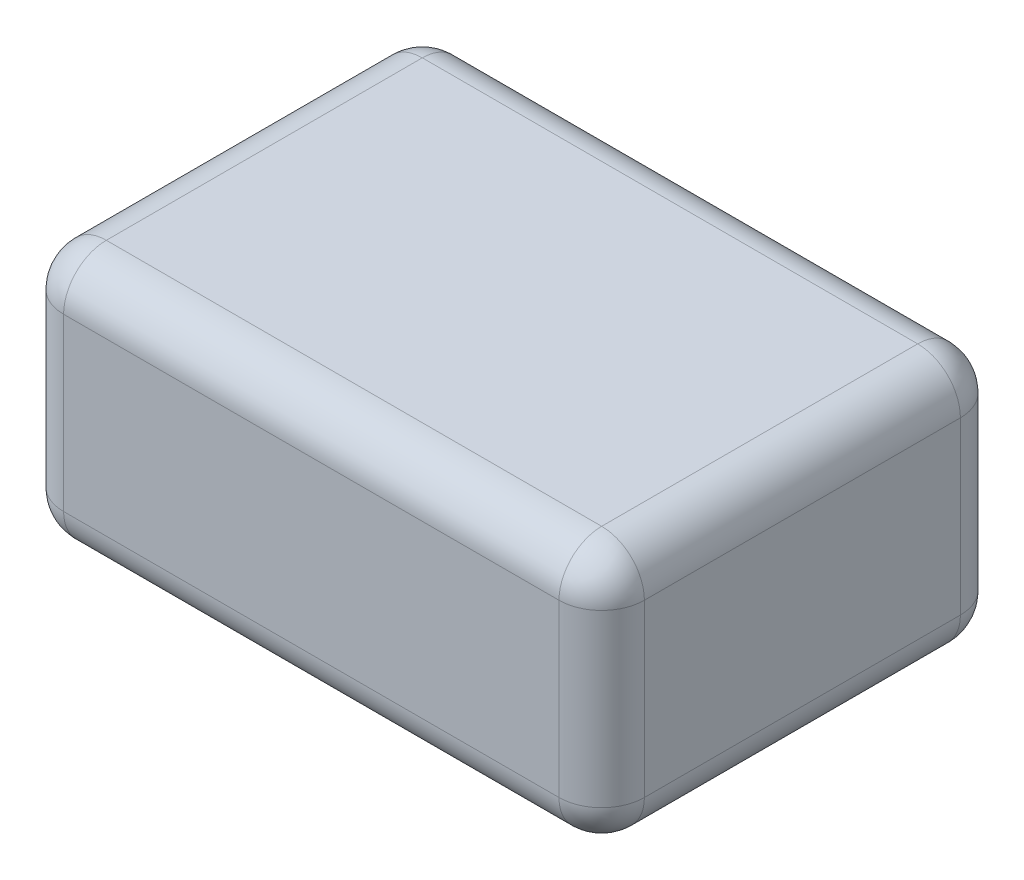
ISO-10303-21;
HEADER;
FILE_DESCRIPTION(('STEP AP214'),'2;1');
FILE_NAME('part.step','',(''),(''),'','','');
FILE_SCHEMA(('AUTOMOTIVE_DESIGN { 1 0 10303 214 1 1 1 1 }'));
ENDSEC;
DATA;
#1=APPLICATION_CONTEXT('core data for automotive mechanical design processes');
#2=APPLICATION_PROTOCOL_DEFINITION('international standard','automotive_design',2000,#1);
#3=PRODUCT_CONTEXT('',#1,'mechanical');
#4=PRODUCT('Part','Part','',(#3));
#5=PRODUCT_RELATED_PRODUCT_CATEGORY('part','',(#4));
#6=PRODUCT_DEFINITION_FORMATION('','',#4);
#7=PRODUCT_DEFINITION_CONTEXT('part definition',#1,'design');
#8=PRODUCT_DEFINITION('design','',#6,#7);
#9=PRODUCT_DEFINITION_SHAPE('','',#8);
#10=(LENGTH_UNIT() NAMED_UNIT(*) SI_UNIT(.MILLI.,.METRE.));
#11=(NAMED_UNIT(*) PLANE_ANGLE_UNIT() SI_UNIT($,.RADIAN.));
#12=(NAMED_UNIT(*) SI_UNIT($,.STERADIAN.) SOLID_ANGLE_UNIT());
#13=UNCERTAINTY_MEASURE_WITH_UNIT(LENGTH_MEASURE(1.E-05),#10,'distance_accuracy_value','');
#14=(GEOMETRIC_REPRESENTATION_CONTEXT(3) GLOBAL_UNCERTAINTY_ASSIGNED_CONTEXT((#13)) GLOBAL_UNIT_ASSIGNED_CONTEXT((#10,
#11,#12)) REPRESENTATION_CONTEXT('',''));
#15=CARTESIAN_POINT('',(0.,0.,0.));
#16=DIRECTION('',(0.,0.,1.));
#17=DIRECTION('',(1.,0.,0.));
#18=AXIS2_PLACEMENT_3D('',#15,#16,#17);
#19=CARTESIAN_POINT('',(0.,0.,47.));
#20=DIRECTION('',(1.,0.,0.));
#21=DIRECTION('',(0.,0.,-1.));
#22=AXIS2_PLACEMENT_3D('',#19,#20,#21);
#23=PLANE('',#22);
#24=DIRECTION('',(0.,0.,-1.));
#25=VECTOR('',#24,1.);
#26=CARTESIAN_POINT('',(0.,5.,47.));
#27=LINE('',#26,#25);
#28=CARTESIAN_POINT('',(0.,5.,5.));
#29=VERTEX_POINT('',#28);
#30=CARTESIAN_POINT('',(0.,5.,42.));
#31=VERTEX_POINT('',#30);
#32=EDGE_CURVE('E129',#29,#31,#27,.F.);
#33=ORIENTED_EDGE('',*,*,#32,.T.);
#34=DIRECTION('',(0.,-1.,0.));
#35=VECTOR('',#34,1.);
#36=CARTESIAN_POINT('',(0.,0.,42.));
#37=LINE('',#36,#35);
#38=CARTESIAN_POINT('',(0.,25.,42.));
#39=VERTEX_POINT('',#38);
#40=EDGE_CURVE('E166',#31,#39,#37,.F.);
#41=ORIENTED_EDGE('',*,*,#40,.T.);
#42=DIRECTION('',(0.,0.,-1.));
#43=VECTOR('',#42,1.);
#44=CARTESIAN_POINT('',(0.,25.,47.));
#45=LINE('',#44,#43);
#46=CARTESIAN_POINT('',(0.,25.,5.));
#47=VERTEX_POINT('',#46);
#48=EDGE_CURVE('E163',#39,#47,#45,.T.);
#49=ORIENTED_EDGE('',*,*,#48,.T.);
#50=DIRECTION('',(0.,-1.,0.));
#51=VECTOR('',#50,1.);
#52=CARTESIAN_POINT('',(0.,0.,5.));
#53=LINE('',#52,#51);
#54=EDGE_CURVE('E158',#47,#29,#53,.T.);
#55=ORIENTED_EDGE('',*,*,#54,.T.);
#56=EDGE_LOOP('',(#33,#41,#49,#55));
#57=FACE_BOUND('',#56,.T.);
#58=ADVANCED_FACE('F33',(#57),#23,.F.);
#59=CARTESIAN_POINT('',(0.,0.,47.));
#60=DIRECTION('',(0.,1.,0.));
#61=DIRECTION('',(0.,0.,1.));
#62=AXIS2_PLACEMENT_3D('',#59,#60,#61);
#63=PLANE('',#62);
#64=DIRECTION('',(0.,0.,-1.));
#65=VECTOR('',#64,1.);
#66=CARTESIAN_POINT('',(63.,0.,47.));
#67=LINE('',#66,#65);
#68=CARTESIAN_POINT('',(63.,0.,5.));
#69=VERTEX_POINT('',#68);
#70=CARTESIAN_POINT('',(63.,0.,42.));
#71=VERTEX_POINT('',#70);
#72=EDGE_CURVE('E151',#69,#71,#67,.F.);
#73=ORIENTED_EDGE('',*,*,#72,.T.);
#74=DIRECTION('',(1.,0.,0.));
#75=VECTOR('',#74,1.);
#76=CARTESIAN_POINT('',(0.,0.,42.));
#77=LINE('',#76,#75);
#78=CARTESIAN_POINT('',(5.,0.,42.));
#79=VERTEX_POINT('',#78);
#80=EDGE_CURVE('E155',#71,#79,#77,.F.);
#81=ORIENTED_EDGE('',*,*,#80,.T.);
#82=DIRECTION('',(0.,0.,-1.));
#83=VECTOR('',#82,1.);
#84=CARTESIAN_POINT('',(5.,0.,47.));
#85=LINE('',#84,#83);
#86=CARTESIAN_POINT('',(5.,0.,5.));
#87=VERTEX_POINT('',#86);
#88=EDGE_CURVE('E127',#79,#87,#85,.T.);
#89=ORIENTED_EDGE('',*,*,#88,.T.);
#90=DIRECTION('',(1.,0.,0.));
#91=VECTOR('',#90,1.);
#92=CARTESIAN_POINT('',(68.,0.,5.));
#93=LINE('',#92,#91);
#94=EDGE_CURVE('E145',#87,#69,#93,.T.);
#95=ORIENTED_EDGE('',*,*,#94,.T.);
#96=EDGE_LOOP('',(#73,#81,#89,#95));
#97=FACE_BOUND('',#96,.T.);
#98=ADVANCED_FACE('F153',(#97),#63,.F.);
#99=CARTESIAN_POINT('',(68.,0.,47.));
#100=DIRECTION('',(-1.,0.,0.));
#101=DIRECTION('',(0.,0.,1.));
#102=AXIS2_PLACEMENT_3D('',#99,#100,#101);
#103=PLANE('',#102);
#104=DIRECTION('',(0.,0.,-1.));
#105=VECTOR('',#104,1.);
#106=CARTESIAN_POINT('',(68.,25.,47.));
#107=LINE('',#106,#105);
#108=CARTESIAN_POINT('',(68.,25.,5.));
#109=VERTEX_POINT('',#108);
#110=CARTESIAN_POINT('',(68.,25.,42.));
#111=VERTEX_POINT('',#110);
#112=EDGE_CURVE('E170',#109,#111,#107,.F.);
#113=ORIENTED_EDGE('',*,*,#112,.T.);
#114=DIRECTION('',(0.,1.,0.));
#115=VECTOR('',#114,1.);
#116=CARTESIAN_POINT('',(68.,0.,42.));
#117=LINE('',#116,#115);
#118=CARTESIAN_POINT('',(68.,5.,42.));
#119=VERTEX_POINT('',#118);
#120=EDGE_CURVE('E175',#111,#119,#117,.F.);
#121=ORIENTED_EDGE('',*,*,#120,.T.);
#122=DIRECTION('',(0.,0.,-1.));
#123=VECTOR('',#122,1.);
#124=CARTESIAN_POINT('',(68.,5.,47.));
#125=LINE('',#124,#123);
#126=CARTESIAN_POINT('',(68.,5.,5.));
#127=VERTEX_POINT('',#126);
#128=EDGE_CURVE('E172',#119,#127,#125,.T.);
#129=ORIENTED_EDGE('',*,*,#128,.T.);
#130=DIRECTION('',(0.,1.,0.));
#131=VECTOR('',#130,1.);
#132=CARTESIAN_POINT('',(68.,30.,5.));
#133=LINE('',#132,#131);
#134=EDGE_CURVE('E168',#127,#109,#133,.T.);
#135=ORIENTED_EDGE('',*,*,#134,.T.);
#136=EDGE_LOOP('',(#113,#121,#129,#135));
#137=FACE_BOUND('',#136,.T.);
#138=ADVANCED_FACE('F280',(#137),#103,.F.);
#139=CARTESIAN_POINT('',(0.,30.,47.));
#140=DIRECTION('',(0.,-1.,0.));
#141=DIRECTION('',(0.,0.,-1.));
#142=AXIS2_PLACEMENT_3D('',#139,#140,#141);
#143=PLANE('',#142);
#144=DIRECTION('',(0.,0.,-1.));
#145=VECTOR('',#144,1.);
#146=CARTESIAN_POINT('',(5.,30.,47.));
#147=LINE('',#146,#145);
#148=CARTESIAN_POINT('',(5.,30.,5.));
#149=VERTEX_POINT('',#148);
#150=CARTESIAN_POINT('',(5.,30.,42.));
#151=VERTEX_POINT('',#150);
#152=EDGE_CURVE('E179',#149,#151,#147,.F.);
#153=ORIENTED_EDGE('',*,*,#152,.T.);
#154=DIRECTION('',(-1.,0.,0.));
#155=VECTOR('',#154,1.);
#156=CARTESIAN_POINT('',(0.,30.,42.));
#157=LINE('',#156,#155);
#158=CARTESIAN_POINT('',(63.,30.,42.));
#159=VERTEX_POINT('',#158);
#160=EDGE_CURVE('E184',#151,#159,#157,.F.);
#161=ORIENTED_EDGE('',*,*,#160,.T.);
#162=DIRECTION('',(0.,0.,-1.));
#163=VECTOR('',#162,1.);
#164=CARTESIAN_POINT('',(63.,30.,47.));
#165=LINE('',#164,#163);
#166=CARTESIAN_POINT('',(63.,30.,5.));
#167=VERTEX_POINT('',#166);
#168=EDGE_CURVE('E181',#159,#167,#165,.T.);
#169=ORIENTED_EDGE('',*,*,#168,.T.);
#170=DIRECTION('',(-1.,0.,0.));
#171=VECTOR('',#170,1.);
#172=CARTESIAN_POINT('',(0.,30.,5.));
#173=LINE('',#172,#171);
#174=EDGE_CURVE('E177',#167,#149,#173,.T.);
#175=ORIENTED_EDGE('',*,*,#174,.T.);
#176=EDGE_LOOP('',(#153,#161,#169,#175));
#177=FACE_BOUND('',#176,.T.);
#178=ADVANCED_FACE('F291',(#177),#143,.F.);
#179=CARTESIAN_POINT('',(0.,30.,47.));
#180=DIRECTION('',(0.,0.,-1.));
#181=DIRECTION('',(-1.,0.,0.));
#182=AXIS2_PLACEMENT_3D('',#179,#180,#181);
#183=PLANE('',#182);
#184=DIRECTION('',(0.,1.,0.));
#185=VECTOR('',#184,1.);
#186=CARTESIAN_POINT('',(63.,30.,47.));
#187=LINE('',#186,#185);
#188=CARTESIAN_POINT('',(63.,5.,47.));
#189=VERTEX_POINT('',#188);
#190=CARTESIAN_POINT('',(63.,25.,47.));
#191=VERTEX_POINT('',#190);
#192=EDGE_CURVE('E190',#189,#191,#187,.T.);
#193=ORIENTED_EDGE('',*,*,#192,.T.);
#194=DIRECTION('',(-1.,0.,0.));
#195=VECTOR('',#194,1.);
#196=CARTESIAN_POINT('',(0.,25.,47.));
#197=LINE('',#196,#195);
#198=CARTESIAN_POINT('',(5.,25.,47.));
#199=VERTEX_POINT('',#198);
#200=EDGE_CURVE('E192',#191,#199,#197,.T.);
#201=ORIENTED_EDGE('',*,*,#200,.T.);
#202=DIRECTION('',(0.,-1.,0.));
#203=VECTOR('',#202,1.);
#204=CARTESIAN_POINT('',(5.,30.,47.));
#205=LINE('',#204,#203);
#206=CARTESIAN_POINT('',(5.,5.,47.));
#207=VERTEX_POINT('',#206);
#208=EDGE_CURVE('E186',#199,#207,#205,.T.);
#209=ORIENTED_EDGE('',*,*,#208,.T.);
#210=DIRECTION('',(1.,0.,0.));
#211=VECTOR('',#210,1.);
#212=CARTESIAN_POINT('',(0.,5.,47.));
#213=LINE('',#212,#211);
#214=EDGE_CURVE('E188',#207,#189,#213,.T.);
#215=ORIENTED_EDGE('',*,*,#214,.T.);
#216=EDGE_LOOP('',(#193,#201,#209,#215));
#217=FACE_BOUND('',#216,.T.);
#218=ADVANCED_FACE('F272',(#217),#183,.F.);
#219=CARTESIAN_POINT('',(0.,30.,0.));
#220=DIRECTION('',(0.,0.,-1.));
#221=DIRECTION('',(-1.,0.,0.));
#222=AXIS2_PLACEMENT_3D('',#219,#220,#221);
#223=PLANE('',#222);
#224=DIRECTION('',(0.,1.,0.));
#225=VECTOR('',#224,1.);
#226=CARTESIAN_POINT('',(63.,0.,0.));
#227=LINE('',#226,#225);
#228=CARTESIAN_POINT('',(63.,25.,0.));
#229=VERTEX_POINT('',#228);
#230=CARTESIAN_POINT('',(63.,5.,0.));
#231=VERTEX_POINT('',#230);
#232=EDGE_CURVE('E42',#229,#231,#227,.F.);
#233=ORIENTED_EDGE('',*,*,#232,.T.);
#234=DIRECTION('',(1.,0.,0.));
#235=VECTOR('',#234,1.);
#236=CARTESIAN_POINT('',(0.,5.,0.));
#237=LINE('',#236,#235);
#238=CARTESIAN_POINT('',(5.,5.,0.));
#239=VERTEX_POINT('',#238);
#240=EDGE_CURVE('E11',#231,#239,#237,.F.);
#241=ORIENTED_EDGE('',*,*,#240,.T.);
#242=DIRECTION('',(0.,-1.,0.));
#243=VECTOR('',#242,1.);
#244=CARTESIAN_POINT('',(5.,30.,0.));
#245=LINE('',#244,#243);
#246=CARTESIAN_POINT('',(5.,25.,0.));
#247=VERTEX_POINT('',#246);
#248=EDGE_CURVE('E195',#239,#247,#245,.F.);
#249=ORIENTED_EDGE('',*,*,#248,.T.);
#250=DIRECTION('',(-1.,0.,0.));
#251=VECTOR('',#250,1.);
#252=CARTESIAN_POINT('',(68.,25.,0.));
#253=LINE('',#252,#251);
#254=EDGE_CURVE('E53',#247,#229,#253,.F.);
#255=ORIENTED_EDGE('',*,*,#254,.T.);
#256=EDGE_LOOP('',(#233,#241,#249,#255));
#257=FACE_BOUND('',#256,.T.);
#258=ADVANCED_FACE('F478',(#257),#223,.T.);
#259=CARTESIAN_POINT('',(63.,25.,47.));
#260=DIRECTION('',(0.,0.,-1.));
#261=DIRECTION('',(-1.,0.,0.));
#262=AXIS2_PLACEMENT_3D('',#259,#260,#261);
#263=CYLINDRICAL_SURFACE('',#262,5.);
#264=CARTESIAN_POINT('',(63.,25.,42.));
#265=DIRECTION('',(0.,0.,1.));
#266=DIRECTION('',(1.,0.,0.));
#267=AXIS2_PLACEMENT_3D('',#264,#265,#266);
#268=CIRCLE('',#267,5.);
#269=EDGE_CURVE('E37',#111,#159,#268,.T.);
#270=ORIENTED_EDGE('',*,*,#269,.F.);
#271=ORIENTED_EDGE('',*,*,#112,.F.);
#272=CARTESIAN_POINT('',(63.,25.,5.));
#273=DIRECTION('',(0.,0.,-1.));
#274=DIRECTION('',(-1.,0.,0.));
#275=AXIS2_PLACEMENT_3D('',#272,#273,#274);
#276=CIRCLE('',#275,5.);
#277=EDGE_CURVE('E249',#167,#109,#276,.T.);
#278=ORIENTED_EDGE('',*,*,#277,.F.);
#279=ORIENTED_EDGE('',*,*,#168,.F.);
#280=EDGE_LOOP('',(#270,#271,#278,#279));
#281=FACE_BOUND('',#280,.T.);
#282=ADVANCED_FACE('F35',(#281),#263,.T.);
#283=CARTESIAN_POINT('',(63.,25.,42.));
#284=DIRECTION('',(0.,0.,1.));
#285=DIRECTION('',(1.,0.,0.));
#286=AXIS2_PLACEMENT_3D('',#283,#284,#285);
#287=SPHERICAL_SURFACE('',#286,5.);
#288=CARTESIAN_POINT('',(63.,25.,42.));
#289=DIRECTION('',(0.,1.,0.));
#290=DIRECTION('',(0.,0.,1.));
#291=AXIS2_PLACEMENT_3D('',#288,#289,#290);
#292=CIRCLE('',#291,5.);
#293=EDGE_CURVE('E244',#111,#191,#292,.F.);
#294=ORIENTED_EDGE('',*,*,#293,.F.);
#295=ORIENTED_EDGE('',*,*,#269,.T.);
#296=CARTESIAN_POINT('',(63.,25.,42.));
#297=DIRECTION('',(1.,0.,0.));
#298=DIRECTION('',(0.,0.,-1.));
#299=AXIS2_PLACEMENT_3D('',#296,#297,#298);
#300=CIRCLE('',#299,5.);
#301=EDGE_CURVE('E247',#191,#159,#300,.F.);
#302=ORIENTED_EDGE('',*,*,#301,.F.);
#303=EDGE_LOOP('',(#294,#295,#302));
#304=FACE_BOUND('',#303,.T.);
#305=ADVANCED_FACE('F260',(#304),#287,.T.);
#306=CARTESIAN_POINT('',(63.,25.,5.));
#307=DIRECTION('',(0.,0.,1.));
#308=DIRECTION('',(1.,0.,0.));
#309=AXIS2_PLACEMENT_3D('',#306,#307,#308);
#310=SPHERICAL_SURFACE('',#309,5.);
#311=CARTESIAN_POINT('',(63.,25.,5.));
#312=DIRECTION('',(1.,0.,0.));
#313=DIRECTION('',(0.,0.,-1.));
#314=AXIS2_PLACEMENT_3D('',#311,#312,#313);
#315=CIRCLE('',#314,5.);
#316=EDGE_CURVE('E239',#167,#229,#315,.F.);
#317=ORIENTED_EDGE('',*,*,#316,.F.);
#318=ORIENTED_EDGE('',*,*,#277,.T.);
#319=CARTESIAN_POINT('',(63.,25.,5.));
#320=DIRECTION('',(0.,1.,0.));
#321=DIRECTION('',(0.,0.,1.));
#322=AXIS2_PLACEMENT_3D('',#319,#320,#321);
#323=CIRCLE('',#322,5.);
#324=EDGE_CURVE('E241',#229,#109,#323,.F.);
#325=ORIENTED_EDGE('',*,*,#324,.F.);
#326=EDGE_LOOP('',(#317,#318,#325));
#327=FACE_BOUND('',#326,.T.);
#328=ADVANCED_FACE('F457',(#327),#310,.T.);
#329=CARTESIAN_POINT('',(0.,25.,42.));
#330=DIRECTION('',(-1.,0.,0.));
#331=DIRECTION('',(0.,0.,1.));
#332=AXIS2_PLACEMENT_3D('',#329,#330,#331);
#333=CYLINDRICAL_SURFACE('',#332,5.);
#334=ORIENTED_EDGE('',*,*,#301,.T.);
#335=ORIENTED_EDGE('',*,*,#160,.F.);
#336=CARTESIAN_POINT('',(5.,25.,42.));
#337=DIRECTION('',(-1.,0.,0.));
#338=DIRECTION('',(0.,0.,1.));
#339=AXIS2_PLACEMENT_3D('',#336,#337,#338);
#340=CIRCLE('',#339,5.);
#341=EDGE_CURVE('E233',#199,#151,#340,.T.);
#342=ORIENTED_EDGE('',*,*,#341,.F.);
#343=ORIENTED_EDGE('',*,*,#200,.F.);
#344=EDGE_LOOP('',(#334,#335,#342,#343));
#345=FACE_BOUND('',#344,.T.);
#346=ADVANCED_FACE('F268',(#345),#333,.T.);
#347=CARTESIAN_POINT('',(63.,30.,42.));
#348=DIRECTION('',(0.,1.,0.));
#349=DIRECTION('',(0.,0.,1.));
#350=AXIS2_PLACEMENT_3D('',#347,#348,#349);
#351=CYLINDRICAL_SURFACE('',#350,5.);
#352=ORIENTED_EDGE('',*,*,#293,.T.);
#353=ORIENTED_EDGE('',*,*,#192,.F.);
#354=CARTESIAN_POINT('',(63.,5.,42.));
#355=DIRECTION('',(0.,-1.,0.));
#356=DIRECTION('',(0.,0.,-1.));
#357=AXIS2_PLACEMENT_3D('',#354,#355,#356);
#358=CIRCLE('',#357,5.);
#359=EDGE_CURVE('E230',#119,#189,#358,.T.);
#360=ORIENTED_EDGE('',*,*,#359,.F.);
#361=ORIENTED_EDGE('',*,*,#120,.F.);
#362=EDGE_LOOP('',(#352,#353,#360,#361));
#363=FACE_BOUND('',#362,.T.);
#364=ADVANCED_FACE('F277',(#363),#351,.T.);
#365=CARTESIAN_POINT('',(63.,5.,47.));
#366=DIRECTION('',(0.,0.,-1.));
#367=DIRECTION('',(-1.,0.,0.));
#368=AXIS2_PLACEMENT_3D('',#365,#366,#367);
#369=CYLINDRICAL_SURFACE('',#368,5.);
#370=CARTESIAN_POINT('',(63.,5.,5.));
#371=DIRECTION('',(0.,0.,-1.));
#372=DIRECTION('',(-1.,0.,0.));
#373=AXIS2_PLACEMENT_3D('',#370,#371,#372);
#374=CIRCLE('',#373,5.);
#375=EDGE_CURVE('E224',#127,#69,#374,.T.);
#376=ORIENTED_EDGE('',*,*,#375,.F.);
#377=ORIENTED_EDGE('',*,*,#128,.F.);
#378=CARTESIAN_POINT('',(63.,5.,42.));
#379=DIRECTION('',(0.,0.,1.));
#380=DIRECTION('',(1.,0.,0.));
#381=AXIS2_PLACEMENT_3D('',#378,#379,#380);
#382=CIRCLE('',#381,5.);
#383=EDGE_CURVE('E227',#71,#119,#382,.T.);
#384=ORIENTED_EDGE('',*,*,#383,.F.);
#385=ORIENTED_EDGE('',*,*,#72,.F.);
#386=EDGE_LOOP('',(#376,#377,#384,#385));
#387=FACE_BOUND('',#386,.T.);
#388=ADVANCED_FACE('F284',(#387),#369,.T.);
#389=CARTESIAN_POINT('',(63.,0.,5.));
#390=DIRECTION('',(0.,-1.,0.));
#391=DIRECTION('',(0.,0.,-1.));
#392=AXIS2_PLACEMENT_3D('',#389,#390,#391);
#393=CYLINDRICAL_SURFACE('',#392,5.);
#394=ORIENTED_EDGE('',*,*,#324,.T.);
#395=ORIENTED_EDGE('',*,*,#134,.F.);
#396=CARTESIAN_POINT('',(63.,5.,5.));
#397=DIRECTION('',(0.,-1.,0.));
#398=DIRECTION('',(0.,0.,-1.));
#399=AXIS2_PLACEMENT_3D('',#396,#397,#398);
#400=CIRCLE('',#399,5.);
#401=EDGE_CURVE('E222',#231,#127,#400,.T.);
#402=ORIENTED_EDGE('',*,*,#401,.F.);
#403=ORIENTED_EDGE('',*,*,#232,.F.);
#404=EDGE_LOOP('',(#394,#395,#402,#403));
#405=FACE_BOUND('',#404,.T.);
#406=ADVANCED_FACE('F289',(#405),#393,.T.);
#407=CARTESIAN_POINT('',(0.,25.,5.));
#408=DIRECTION('',(1.,0.,0.));
#409=DIRECTION('',(0.,0.,-1.));
#410=AXIS2_PLACEMENT_3D('',#407,#408,#409);
#411=CYLINDRICAL_SURFACE('',#410,5.);
#412=ORIENTED_EDGE('',*,*,#316,.T.);
#413=ORIENTED_EDGE('',*,*,#254,.F.);
#414=CARTESIAN_POINT('',(5.,25.,5.));
#415=DIRECTION('',(-1.,0.,0.));
#416=DIRECTION('',(0.,0.,1.));
#417=AXIS2_PLACEMENT_3D('',#414,#415,#416);
#418=CIRCLE('',#417,5.);
#419=EDGE_CURVE('E219',#149,#247,#418,.T.);
#420=ORIENTED_EDGE('',*,*,#419,.F.);
#421=ORIENTED_EDGE('',*,*,#174,.F.);
#422=EDGE_LOOP('',(#412,#413,#420,#421));
#423=FACE_BOUND('',#422,.T.);
#424=ADVANCED_FACE('F300',(#423),#411,.T.);
#425=CARTESIAN_POINT('',(5.,25.,47.));
#426=DIRECTION('',(0.,0.,-1.));
#427=DIRECTION('',(-1.,0.,0.));
#428=AXIS2_PLACEMENT_3D('',#425,#426,#427);
#429=CYLINDRICAL_SURFACE('',#428,5.);
#430=CARTESIAN_POINT('',(5.,25.,42.));
#431=DIRECTION('',(0.,0.,1.));
#432=DIRECTION('',(1.,0.,0.));
#433=AXIS2_PLACEMENT_3D('',#430,#431,#432);
#434=CIRCLE('',#433,5.);
#435=EDGE_CURVE('E236',#151,#39,#434,.T.);
#436=ORIENTED_EDGE('',*,*,#435,.F.);
#437=ORIENTED_EDGE('',*,*,#152,.F.);
#438=CARTESIAN_POINT('',(5.,25.,5.));
#439=DIRECTION('',(0.,0.,-1.));
#440=DIRECTION('',(-1.,0.,0.));
#441=AXIS2_PLACEMENT_3D('',#438,#439,#440);
#442=CIRCLE('',#441,5.);
#443=EDGE_CURVE('E216',#47,#149,#442,.T.);
#444=ORIENTED_EDGE('',*,*,#443,.F.);
#445=ORIENTED_EDGE('',*,*,#48,.F.);
#446=EDGE_LOOP('',(#436,#437,#444,#445));
#447=FACE_BOUND('',#446,.T.);
#448=ADVANCED_FACE('F296',(#447),#429,.T.);
#449=CARTESIAN_POINT('',(5.,25.,42.));
#450=DIRECTION('',(0.,0.,1.));
#451=DIRECTION('',(1.,0.,0.));
#452=AXIS2_PLACEMENT_3D('',#449,#450,#451);
#453=SPHERICAL_SURFACE('',#452,5.);
#454=ORIENTED_EDGE('',*,*,#341,.T.);
#455=ORIENTED_EDGE('',*,*,#435,.T.);
#456=CARTESIAN_POINT('',(5.,25.,42.));
#457=DIRECTION('',(0.,1.,0.));
#458=DIRECTION('',(0.,0.,1.));
#459=AXIS2_PLACEMENT_3D('',#456,#457,#458);
#460=CIRCLE('',#459,5.);
#461=EDGE_CURVE('E213',#199,#39,#460,.F.);
#462=ORIENTED_EDGE('',*,*,#461,.F.);
#463=EDGE_LOOP('',(#454,#455,#462));
#464=FACE_BOUND('',#463,.T.);
#465=ADVANCED_FACE('F310',(#464),#453,.T.);
#466=CARTESIAN_POINT('',(63.,5.,42.));
#467=DIRECTION('',(0.,0.,1.));
#468=DIRECTION('',(1.,0.,0.));
#469=AXIS2_PLACEMENT_3D('',#466,#467,#468);
#470=SPHERICAL_SURFACE('',#469,5.);
#471=ORIENTED_EDGE('',*,*,#383,.T.);
#472=ORIENTED_EDGE('',*,*,#359,.T.);
#473=CARTESIAN_POINT('',(63.,5.,42.));
#474=DIRECTION('',(1.,0.,0.));
#475=DIRECTION('',(0.,0.,-1.));
#476=AXIS2_PLACEMENT_3D('',#473,#474,#475);
#477=CIRCLE('',#476,5.);
#478=EDGE_CURVE('E210',#71,#189,#477,.F.);
#479=ORIENTED_EDGE('',*,*,#478,.F.);
#480=EDGE_LOOP('',(#471,#472,#479));
#481=FACE_BOUND('',#480,.T.);
#482=ADVANCED_FACE('F320',(#481),#470,.T.);
#483=CARTESIAN_POINT('',(63.,5.,5.));
#484=DIRECTION('',(0.,0.,1.));
#485=DIRECTION('',(1.,0.,0.));
#486=AXIS2_PLACEMENT_3D('',#483,#484,#485);
#487=SPHERICAL_SURFACE('',#486,5.);
#488=ORIENTED_EDGE('',*,*,#401,.T.);
#489=ORIENTED_EDGE('',*,*,#375,.T.);
#490=CARTESIAN_POINT('',(63.,5.,5.));
#491=DIRECTION('',(1.,0.,0.));
#492=DIRECTION('',(0.,0.,-1.));
#493=AXIS2_PLACEMENT_3D('',#490,#491,#492);
#494=CIRCLE('',#493,5.);
#495=EDGE_CURVE('E148',#231,#69,#494,.F.);
#496=ORIENTED_EDGE('',*,*,#495,.F.);
#497=EDGE_LOOP('',(#488,#489,#496));
#498=FACE_BOUND('',#497,.T.);
#499=ADVANCED_FACE('F322',(#498),#487,.T.);
#500=CARTESIAN_POINT('',(5.,25.,5.));
#501=DIRECTION('',(0.,0.,1.));
#502=DIRECTION('',(1.,0.,0.));
#503=AXIS2_PLACEMENT_3D('',#500,#501,#502);
#504=SPHERICAL_SURFACE('',#503,5.);
#505=ORIENTED_EDGE('',*,*,#443,.T.);
#506=ORIENTED_EDGE('',*,*,#419,.T.);
#507=CARTESIAN_POINT('',(5.,25.,5.));
#508=DIRECTION('',(0.,1.,0.));
#509=DIRECTION('',(0.,0.,1.));
#510=AXIS2_PLACEMENT_3D('',#507,#508,#509);
#511=CIRCLE('',#510,5.);
#512=EDGE_CURVE('E206',#47,#247,#511,.F.);
#513=ORIENTED_EDGE('',*,*,#512,.F.);
#514=EDGE_LOOP('',(#505,#506,#513));
#515=FACE_BOUND('',#514,.T.);
#516=ADVANCED_FACE('F302',(#515),#504,.T.);
#517=CARTESIAN_POINT('',(5.,30.,42.));
#518=DIRECTION('',(0.,-1.,0.));
#519=DIRECTION('',(0.,0.,-1.));
#520=AXIS2_PLACEMENT_3D('',#517,#518,#519);
#521=CYLINDRICAL_SURFACE('',#520,5.);
#522=ORIENTED_EDGE('',*,*,#461,.T.);
#523=ORIENTED_EDGE('',*,*,#40,.F.);
#524=CARTESIAN_POINT('',(5.,5.,42.));
#525=DIRECTION('',(0.,-1.,0.));
#526=DIRECTION('',(1.,0.,0.));
#527=AXIS2_PLACEMENT_3D('',#524,#525,#526);
#528=CIRCLE('',#527,5.);
#529=EDGE_CURVE('E203',#207,#31,#528,.T.);
#530=ORIENTED_EDGE('',*,*,#529,.F.);
#531=ORIENTED_EDGE('',*,*,#208,.F.);
#532=EDGE_LOOP('',(#522,#523,#530,#531));
#533=FACE_BOUND('',#532,.T.);
#534=ADVANCED_FACE('F312',(#533),#521,.T.);
#535=CARTESIAN_POINT('',(0.,5.,42.));
#536=DIRECTION('',(1.,0.,0.));
#537=DIRECTION('',(0.,0.,-1.));
#538=AXIS2_PLACEMENT_3D('',#535,#536,#537);
#539=CYLINDRICAL_SURFACE('',#538,5.);
#540=ORIENTED_EDGE('',*,*,#478,.T.);
#541=ORIENTED_EDGE('',*,*,#214,.F.);
#542=CARTESIAN_POINT('',(5.,5.,42.));
#543=DIRECTION('',(-1.,0.,0.));
#544=DIRECTION('',(0.,0.,1.));
#545=AXIS2_PLACEMENT_3D('',#542,#543,#544);
#546=CIRCLE('',#545,5.);
#547=EDGE_CURVE('E142',#79,#207,#546,.T.);
#548=ORIENTED_EDGE('',*,*,#547,.F.);
#549=ORIENTED_EDGE('',*,*,#80,.F.);
#550=EDGE_LOOP('',(#540,#541,#548,#549));
#551=FACE_BOUND('',#550,.T.);
#552=ADVANCED_FACE('F318',(#551),#539,.T.);
#553=CARTESIAN_POINT('',(0.,5.,5.));
#554=DIRECTION('',(-1.,0.,0.));
#555=DIRECTION('',(0.,0.,1.));
#556=AXIS2_PLACEMENT_3D('',#553,#554,#555);
#557=CYLINDRICAL_SURFACE('',#556,5.);
#558=ORIENTED_EDGE('',*,*,#495,.T.);
#559=ORIENTED_EDGE('',*,*,#94,.F.);
#560=CARTESIAN_POINT('',(5.,5.,5.));
#561=DIRECTION('',(-1.,0.,0.));
#562=DIRECTION('',(0.,0.,1.));
#563=AXIS2_PLACEMENT_3D('',#560,#561,#562);
#564=CIRCLE('',#563,5.);
#565=EDGE_CURVE('E134',#239,#87,#564,.T.);
#566=ORIENTED_EDGE('',*,*,#565,.F.);
#567=ORIENTED_EDGE('',*,*,#240,.F.);
#568=EDGE_LOOP('',(#558,#559,#566,#567));
#569=FACE_BOUND('',#568,.T.);
#570=ADVANCED_FACE('F146',(#569),#557,.T.);
#571=CARTESIAN_POINT('',(5.,0.,5.));
#572=DIRECTION('',(0.,1.,0.));
#573=DIRECTION('',(0.,0.,1.));
#574=AXIS2_PLACEMENT_3D('',#571,#572,#573);
#575=CYLINDRICAL_SURFACE('',#574,5.);
#576=ORIENTED_EDGE('',*,*,#512,.T.);
#577=ORIENTED_EDGE('',*,*,#248,.F.);
#578=CARTESIAN_POINT('',(5.,5.,5.));
#579=DIRECTION('',(0.,-1.,0.));
#580=DIRECTION('',(0.,0.,-1.));
#581=AXIS2_PLACEMENT_3D('',#578,#579,#580);
#582=CIRCLE('',#581,5.);
#583=EDGE_CURVE('E138',#29,#239,#582,.T.);
#584=ORIENTED_EDGE('',*,*,#583,.F.);
#585=ORIENTED_EDGE('',*,*,#54,.F.);
#586=EDGE_LOOP('',(#576,#577,#584,#585));
#587=FACE_BOUND('',#586,.T.);
#588=ADVANCED_FACE('F305',(#587),#575,.T.);
#589=CARTESIAN_POINT('',(5.,5.,42.));
#590=DIRECTION('',(0.,0.,1.));
#591=DIRECTION('',(1.,0.,0.));
#592=AXIS2_PLACEMENT_3D('',#589,#590,#591);
#593=SPHERICAL_SURFACE('',#592,5.);
#594=ORIENTED_EDGE('',*,*,#547,.T.);
#595=ORIENTED_EDGE('',*,*,#529,.T.);
#596=CARTESIAN_POINT('',(5.,5.,42.));
#597=DIRECTION('',(0.,0.,1.));
#598=DIRECTION('',(1.,0.,0.));
#599=AXIS2_PLACEMENT_3D('',#596,#597,#598);
#600=CIRCLE('',#599,5.);
#601=EDGE_CURVE('E131',#79,#31,#600,.F.);
#602=ORIENTED_EDGE('',*,*,#601,.F.);
#603=EDGE_LOOP('',(#594,#595,#602));
#604=FACE_BOUND('',#603,.T.);
#605=ADVANCED_FACE('F316',(#604),#593,.T.);
#606=CARTESIAN_POINT('',(5.,5.,5.));
#607=DIRECTION('',(0.,0.,1.));
#608=DIRECTION('',(1.,0.,0.));
#609=AXIS2_PLACEMENT_3D('',#606,#607,#608);
#610=SPHERICAL_SURFACE('',#609,5.);
#611=ORIENTED_EDGE('',*,*,#583,.T.);
#612=ORIENTED_EDGE('',*,*,#565,.T.);
#613=CARTESIAN_POINT('',(5.,5.,5.));
#614=DIRECTION('',(0.,0.,-1.));
#615=DIRECTION('',(-1.,0.,0.));
#616=AXIS2_PLACEMENT_3D('',#613,#614,#615);
#617=CIRCLE('',#616,5.);
#618=EDGE_CURVE('E123',#29,#87,#617,.F.);
#619=ORIENTED_EDGE('',*,*,#618,.F.);
#620=EDGE_LOOP('',(#611,#612,#619));
#621=FACE_BOUND('',#620,.T.);
#622=ADVANCED_FACE('F136',(#621),#610,.T.);
#623=CARTESIAN_POINT('',(5.,5.,47.));
#624=DIRECTION('',(0.,0.,-1.));
#625=DIRECTION('',(-1.,0.,0.));
#626=AXIS2_PLACEMENT_3D('',#623,#624,#625);
#627=CYLINDRICAL_SURFACE('',#626,5.);
#628=ORIENTED_EDGE('',*,*,#601,.T.);
#629=ORIENTED_EDGE('',*,*,#32,.F.);
#630=ORIENTED_EDGE('',*,*,#618,.T.);
#631=ORIENTED_EDGE('',*,*,#88,.F.);
#632=EDGE_LOOP('',(#628,#629,#630,#631));
#633=FACE_BOUND('',#632,.T.);
#634=ADVANCED_FACE('F125',(#633),#627,.T.);
#635=CLOSED_SHELL('',(#58,#98,#138,#178,#218,#258,#282,#305,#328,#346,#364,#388,#406,#424,#448,
#465,#482,#499,#516,#534,#552,#570,#588,#605,#622,#634));
#636=MANIFOLD_SOLID_BREP('B2',#635);
#637=ADVANCED_BREP_SHAPE_REPRESENTATION('',(#18,#636),#14);
#638=SHAPE_DEFINITION_REPRESENTATION(#9,#637);
ENDSEC;
END-ISO-10303-21;
